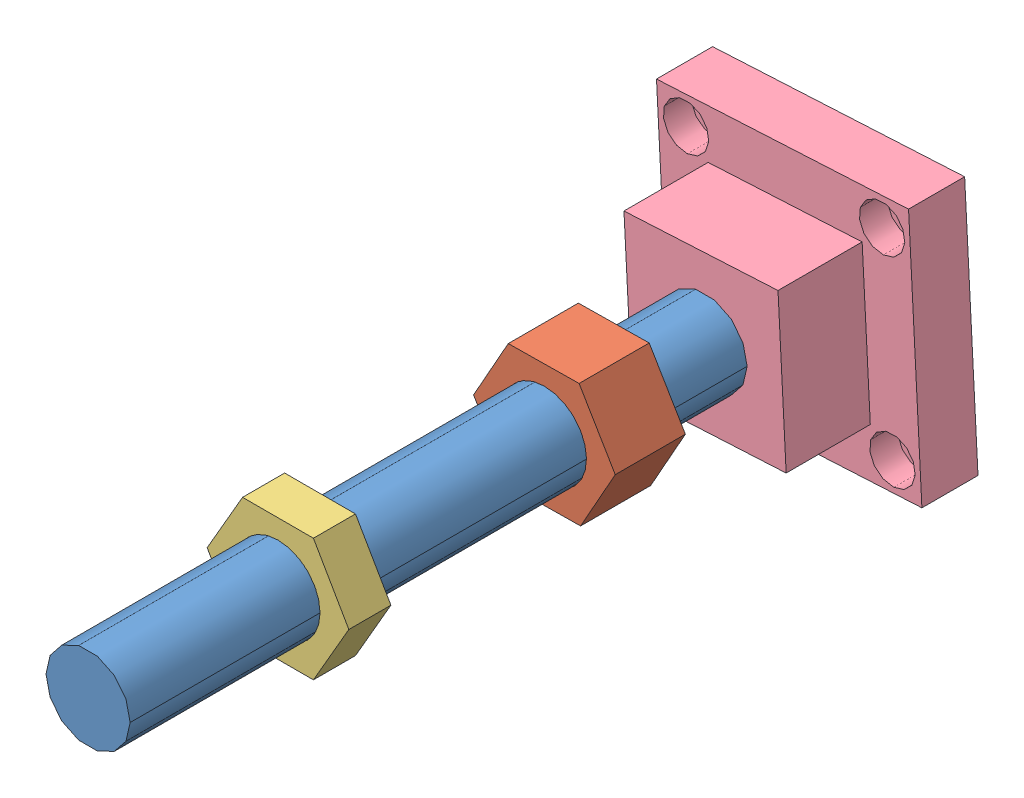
SolidWorks assembly 1080 RIGHT KM SUPPORT.SLDASM, configuration K1 (file format 4400). Lengths in mm.
Overall size (120.19 120.19 342.9).
8 component instances, 8 part files, 6 mates.
Components (placement in the parent):
- _U109-2-1: _U109-2.sldprt [Default] at origin
- _U126-2-1: _U126-2.sldprt [Default] at (0 0 -209.55) (suppressed, hidden)
- _U127-2-1: _U127-2.sldprt [Default] at (0 0 -171.45) (suppressed, hidden)
- _U128-2-1: _U128-2.sldprt [Default] at (0 0 -192.0875) (suppressed, hidden)
- _U129-2-1: _U129-2.sldprt [Default] at (0 0 -198.4375) (suppressed, hidden)
- _U181-2-1: _U181-2.sldprt [Default] at (0 0 -70.1319) x (0.999926 0.012181 0) z (0 0 1)
- _U182-2-1: _U182-2.sldprt [Default] at (0 0 56.8681)
- 1080-C1017 BASE PAD, OSIRIS, KECK 1-1: 1080-C1017 BASE PAD, OSIRIS, KECK 1.SLDPRT [Default] at (-54.0454 -60.0945 -190.5) x (0.998599 0.052923 0) z (0.052923 -0.998599 0)
Mates (geometry in assembly coordinates):
- Concentric1: concentric aligned: cylinder of _U109-2-1 through (0 0 -152.4) axis (0 0 1) radius 19.05; cylinder of 1080-C1017 BASE PAD, OSIRIS, KECK 1-1 through (0 0 -127) axis (0 0 1) radius 12.7
- Distance1: distance = 25.4 mm anti-aligned: plane of _U109-2-1 through (0 0 -152.4) normal (0 0 -1); plane of 1080-C1017 BASE PAD, OSIRIS, KECK 1-1 through (-36.7244 33.0277 -127) normal (0 0 1)
- Concentric2: concentric aligned: cylinder of _U109-2-1 through (0 0 -152.4) axis (0 0 1) radius 19.05; cylinder of _U182-2-1 through (0 0 -167.4359) axis (0 0 1) radius 19.05
- Concentric3: concentric aligned: cylinder of _U109-2-1 through (0 0 -152.4) axis (0 0 1) radius 19.05; cylinder of _U181-2-1 through (0 0 -159.957) axis (0 0 1) radius 19.05
- Distance2: distance = 174.3431 mm anti-aligned: plane of 1080-C1017 BASE PAD, OSIRIS, KECK 1-1 through (-36.7244 33.0277 -127) normal (0 0 1); plane of _U182-2-1 through (0 0 47.3431) normal (0 0 -1)
- Distance3: distance = 101.6 mm anti-aligned: plane of _U181-2-1 through (-16.3767 27.5838 -54.2569) normal (0 0 1); plane of _U182-2-1 through (0 0 47.3431) normal (0 0 -1)
